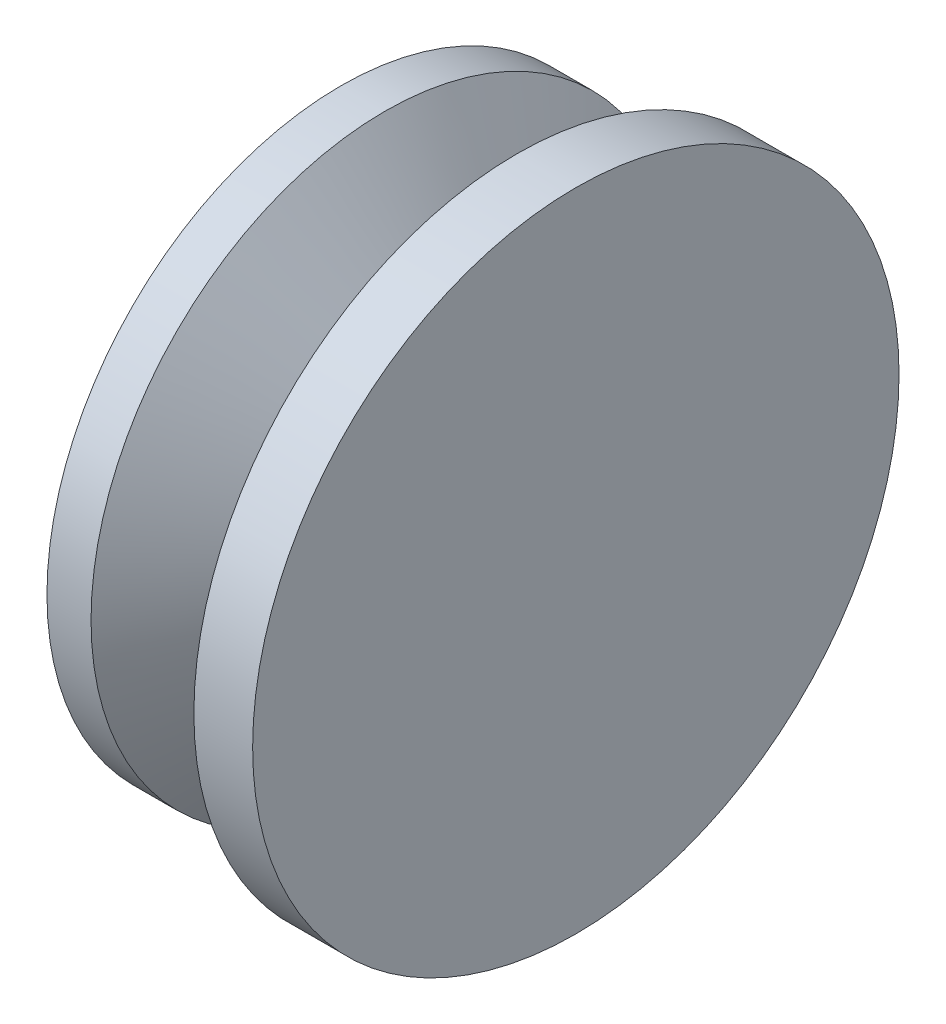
ISO-10303-21;
HEADER;
FILE_DESCRIPTION(('STEP AP214'),'2;1');
FILE_NAME('part.step','',(''),(''),'','','');
FILE_SCHEMA(('AUTOMOTIVE_DESIGN { 1 0 10303 214 1 1 1 1 }'));
ENDSEC;
DATA;
#1=APPLICATION_CONTEXT('core data for automotive mechanical design processes');
#2=APPLICATION_PROTOCOL_DEFINITION('international standard','automotive_design',2000,#1);
#3=PRODUCT_CONTEXT('',#1,'mechanical');
#4=PRODUCT('Part','Part','',(#3));
#5=PRODUCT_RELATED_PRODUCT_CATEGORY('part','',(#4));
#6=PRODUCT_DEFINITION_FORMATION('','',#4);
#7=PRODUCT_DEFINITION_CONTEXT('part definition',#1,'design');
#8=PRODUCT_DEFINITION('design','',#6,#7);
#9=PRODUCT_DEFINITION_SHAPE('','',#8);
#10=(LENGTH_UNIT() NAMED_UNIT(*) SI_UNIT(.MILLI.,.METRE.));
#11=(NAMED_UNIT(*) PLANE_ANGLE_UNIT() SI_UNIT($,.RADIAN.));
#12=(NAMED_UNIT(*) SI_UNIT($,.STERADIAN.) SOLID_ANGLE_UNIT());
#13=UNCERTAINTY_MEASURE_WITH_UNIT(LENGTH_MEASURE(1.E-05),#10,'distance_accuracy_value','');
#14=(GEOMETRIC_REPRESENTATION_CONTEXT(3) GLOBAL_UNCERTAINTY_ASSIGNED_CONTEXT((#13)) GLOBAL_UNIT_ASSIGNED_CONTEXT((#10,
#11,#12)) REPRESENTATION_CONTEXT('',''));
#15=CARTESIAN_POINT('',(0.,0.,0.));
#16=DIRECTION('',(0.,0.,1.));
#17=DIRECTION('',(1.,0.,0.));
#18=AXIS2_PLACEMENT_3D('',#15,#16,#17);
#19=CARTESIAN_POINT('',(51.,39.,25.));
#20=DIRECTION('',(-1.,0.,0.));
#21=DIRECTION('',(0.,0.,1.));
#22=AXIS2_PLACEMENT_3D('',#19,#20,#21);
#23=PLANE('',#22);
#24=CARTESIAN_POINT('',(51.,39.,25.));
#25=DIRECTION('',(1.,0.,0.));
#26=DIRECTION('',(0.,0.,-1.));
#27=AXIS2_PLACEMENT_3D('',#24,#25,#26);
#28=CIRCLE('',#27,10.);
#29=CARTESIAN_POINT('',(51.,39.,15.));
#30=VERTEX_POINT('',#29);
#31=EDGE_CURVE('E10',#30,#30,#28,.T.);
#32=ORIENTED_EDGE('',*,*,#31,.F.);
#33=EDGE_LOOP('',(#32));
#34=FACE_BOUND('',#33,.T.);
#35=ADVANCED_FACE('F29',(#34),#23,.T.);
#36=CARTESIAN_POINT('',(58.,39.,25.));
#37=DIRECTION('',(1.,0.,0.));
#38=DIRECTION('',(0.,0.,-1.));
#39=AXIS2_PLACEMENT_3D('',#36,#37,#38);
#40=CYLINDRICAL_SURFACE('',#39,10.);
#41=ORIENTED_EDGE('',*,*,#31,.T.);
#42=EDGE_LOOP('',(#41));
#43=FACE_BOUND('',#42,.T.);
#44=CARTESIAN_POINT('',(52.5,39.,25.));
#45=DIRECTION('',(1.,0.,0.));
#46=DIRECTION('',(0.,0.,-1.));
#47=AXIS2_PLACEMENT_3D('',#44,#45,#46);
#48=CIRCLE('',#47,10.);
#49=CARTESIAN_POINT('',(52.5,39.,15.));
#50=VERTEX_POINT('',#49);
#51=EDGE_CURVE('E35',#50,#50,#48,.T.);
#52=ORIENTED_EDGE('',*,*,#51,.F.);
#53=EDGE_LOOP('',(#52));
#54=FACE_BOUND('',#53,.T.);
#55=ADVANCED_FACE('F71',(#43,#54),#40,.T.);
#56=CARTESIAN_POINT('',(54.5,39.,25.));
#57=DIRECTION('',(-1.,0.,0.));
#58=DIRECTION('',(0.,0.,1.));
#59=AXIS2_PLACEMENT_3D('',#56,#57,#58);
#60=CONICAL_SURFACE('',#59,7.00413996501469,0.98215619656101);
#61=ORIENTED_EDGE('',*,*,#51,.T.);
#62=EDGE_LOOP('',(#61));
#63=FACE_BOUND('',#62,.T.);
#64=CARTESIAN_POINT('',(54.5,39.,25.));
#65=DIRECTION('',(1.,0.,0.));
#66=DIRECTION('',(0.,0.,-1.));
#67=AXIS2_PLACEMENT_3D('',#64,#65,#66);
#68=CIRCLE('',#67,7.00413996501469);
#69=CARTESIAN_POINT('',(54.5,39.,17.9958600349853));
#70=VERTEX_POINT('',#69);
#71=EDGE_CURVE('E39',#70,#70,#68,.T.);
#72=ORIENTED_EDGE('',*,*,#71,.F.);
#73=EDGE_LOOP('',(#72));
#74=FACE_BOUND('',#73,.T.);
#75=ADVANCED_FACE('F76',(#63,#74),#60,.T.);
#76=CARTESIAN_POINT('',(58.,39.,25.));
#77=DIRECTION('',(1.,0.,0.));
#78=DIRECTION('',(0.,0.,-1.));
#79=AXIS2_PLACEMENT_3D('',#76,#77,#78);
#80=CYLINDRICAL_SURFACE('',#79,7.00413996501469);
#81=ORIENTED_EDGE('',*,*,#71,.T.);
#82=EDGE_LOOP('',(#81));
#83=FACE_BOUND('',#82,.T.);
#84=CARTESIAN_POINT('',(57.,39.,25.));
#85=DIRECTION('',(1.,0.,0.));
#86=DIRECTION('',(0.,0.,-1.));
#87=AXIS2_PLACEMENT_3D('',#84,#85,#86);
#88=CIRCLE('',#87,7.00413996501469);
#89=CARTESIAN_POINT('',(57.,39.,17.9958600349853));
#90=VERTEX_POINT('',#89);
#91=EDGE_CURVE('E43',#90,#90,#88,.T.);
#92=ORIENTED_EDGE('',*,*,#91,.F.);
#93=EDGE_LOOP('',(#92));
#94=FACE_BOUND('',#93,.T.);
#95=ADVANCED_FACE('F67',(#83,#94),#80,.T.);
#96=CARTESIAN_POINT('',(57.,46.0041399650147,25.));
#97=DIRECTION('',(-1.,0.,0.));
#98=DIRECTION('',(0.,0.,1.));
#99=AXIS2_PLACEMENT_3D('',#96,#97,#98);
#100=PLANE('',#99);
#101=ORIENTED_EDGE('',*,*,#91,.T.);
#102=EDGE_LOOP('',(#101));
#103=FACE_BOUND('',#102,.T.);
#104=CARTESIAN_POINT('',(57.,39.,25.));
#105=DIRECTION('',(1.,0.,0.));
#106=DIRECTION('',(0.,0.,-1.));
#107=AXIS2_PLACEMENT_3D('',#104,#105,#106);
#108=CIRCLE('',#107,11.);
#109=CARTESIAN_POINT('',(57.,39.,14.));
#110=VERTEX_POINT('',#109);
#111=EDGE_CURVE('E48',#110,#110,#108,.T.);
#112=ORIENTED_EDGE('',*,*,#111,.F.);
#113=EDGE_LOOP('',(#112));
#114=FACE_BOUND('',#113,.T.);
#115=ADVANCED_FACE('F59',(#103,#114),#100,.T.);
#116=CARTESIAN_POINT('',(58.,39.,25.));
#117=DIRECTION('',(1.,0.,0.));
#118=DIRECTION('',(0.,0.,-1.));
#119=AXIS2_PLACEMENT_3D('',#116,#117,#118);
#120=CYLINDRICAL_SURFACE('',#119,11.);
#121=ORIENTED_EDGE('',*,*,#111,.T.);
#122=EDGE_LOOP('',(#121));
#123=FACE_BOUND('',#122,.T.);
#124=CARTESIAN_POINT('',(59.,39.,25.));
#125=DIRECTION('',(1.,0.,0.));
#126=DIRECTION('',(0.,0.,-1.));
#127=AXIS2_PLACEMENT_3D('',#124,#125,#126);
#128=CIRCLE('',#127,11.);
#129=CARTESIAN_POINT('',(59.,39.,14.));
#130=VERTEX_POINT('',#129);
#131=EDGE_CURVE('E51',#130,#130,#128,.T.);
#132=ORIENTED_EDGE('',*,*,#131,.F.);
#133=EDGE_LOOP('',(#132));
#134=FACE_BOUND('',#133,.T.);
#135=ADVANCED_FACE('F57',(#123,#134),#120,.T.);
#136=CARTESIAN_POINT('',(59.,50.,25.));
#137=DIRECTION('',(1.,0.,0.));
#138=DIRECTION('',(0.,0.,-1.));
#139=AXIS2_PLACEMENT_3D('',#136,#137,#138);
#140=PLANE('',#139);
#141=ORIENTED_EDGE('',*,*,#131,.T.);
#142=EDGE_LOOP('',(#141));
#143=FACE_BOUND('',#142,.T.);
#144=ADVANCED_FACE('F55',(#143),#140,.T.);
#145=CLOSED_SHELL('',(#35,#55,#75,#95,#115,#135,#144));
#146=MANIFOLD_SOLID_BREP('B2',#145);
#147=ADVANCED_BREP_SHAPE_REPRESENTATION('',(#18,#146),#14);
#148=SHAPE_DEFINITION_REPRESENTATION(#9,#147);
ENDSEC;
END-ISO-10303-21;
